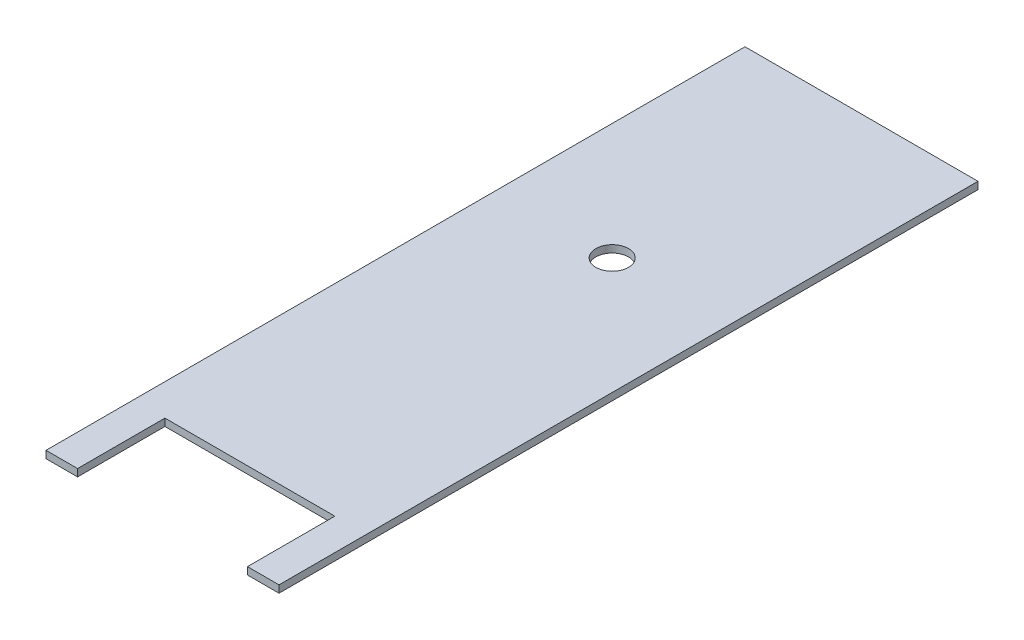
ISO-10303-21;
HEADER;
FILE_DESCRIPTION(('STEP AP214'),'2;1');
FILE_NAME('part.step','',(''),(''),'','','');
FILE_SCHEMA(('AUTOMOTIVE_DESIGN { 1 0 10303 214 1 1 1 1 }'));
ENDSEC;
DATA;
#1=APPLICATION_CONTEXT('core data for automotive mechanical design processes');
#2=APPLICATION_PROTOCOL_DEFINITION('international standard','automotive_design',2000,#1);
#3=PRODUCT_CONTEXT('',#1,'mechanical');
#4=PRODUCT('Part','Part','',(#3));
#5=PRODUCT_RELATED_PRODUCT_CATEGORY('part','',(#4));
#6=PRODUCT_DEFINITION_FORMATION('','',#4);
#7=PRODUCT_DEFINITION_CONTEXT('part definition',#1,'design');
#8=PRODUCT_DEFINITION('design','',#6,#7);
#9=PRODUCT_DEFINITION_SHAPE('','',#8);
#10=(LENGTH_UNIT() NAMED_UNIT(*) SI_UNIT(.MILLI.,.METRE.));
#11=(NAMED_UNIT(*) PLANE_ANGLE_UNIT() SI_UNIT($,.RADIAN.));
#12=(NAMED_UNIT(*) SI_UNIT($,.STERADIAN.) SOLID_ANGLE_UNIT());
#13=UNCERTAINTY_MEASURE_WITH_UNIT(LENGTH_MEASURE(1.E-05),#10,'distance_accuracy_value','');
#14=(GEOMETRIC_REPRESENTATION_CONTEXT(3) GLOBAL_UNCERTAINTY_ASSIGNED_CONTEXT((#13)) GLOBAL_UNIT_ASSIGNED_CONTEXT((#10,
#11,#12)) REPRESENTATION_CONTEXT('',''));
#15=CARTESIAN_POINT('',(0.,0.,0.));
#16=DIRECTION('',(0.,0.,1.));
#17=DIRECTION('',(1.,0.,0.));
#18=AXIS2_PLACEMENT_3D('',#15,#16,#17);
#19=CARTESIAN_POINT('',(-76.2,4.7625,228.6));
#20=DIRECTION('',(0.,0.,-1.));
#21=DIRECTION('',(-1.,0.,0.));
#22=AXIS2_PLACEMENT_3D('',#19,#20,#21);
#23=PLANE('',#22);
#24=DIRECTION('',(1.,0.,0.));
#25=VECTOR('',#24,1.);
#26=CARTESIAN_POINT('',(-76.2,0.,228.6));
#27=LINE('',#26,#25);
#28=CARTESIAN_POINT('',(-76.2,0.,228.6));
#29=VERTEX_POINT('',#28);
#30=CARTESIAN_POINT('',(-55.5625,0.,228.6));
#31=VERTEX_POINT('',#30);
#32=EDGE_CURVE('E161',#29,#31,#27,.T.);
#33=ORIENTED_EDGE('',*,*,#32,.T.);
#34=DIRECTION('',(0.,1.,0.));
#35=VECTOR('',#34,1.);
#36=CARTESIAN_POINT('',(-55.5625,0.,228.6));
#37=LINE('',#36,#35);
#38=CARTESIAN_POINT('',(-55.5625,4.7625,228.6));
#39=VERTEX_POINT('',#38);
#40=EDGE_CURVE('E152',#31,#39,#37,.T.);
#41=ORIENTED_EDGE('',*,*,#40,.T.);
#42=DIRECTION('',(1.,0.,0.));
#43=VECTOR('',#42,1.);
#44=CARTESIAN_POINT('',(-76.2,4.7625,228.6));
#45=LINE('',#44,#43);
#46=CARTESIAN_POINT('',(-76.2,4.7625,228.6));
#47=VERTEX_POINT('',#46);
#48=EDGE_CURVE('E138',#47,#39,#45,.T.);
#49=ORIENTED_EDGE('',*,*,#48,.F.);
#50=DIRECTION('',(0.,-1.,0.));
#51=VECTOR('',#50,1.);
#52=CARTESIAN_POINT('',(-76.2,4.7625,228.6));
#53=LINE('',#52,#51);
#54=EDGE_CURVE('E185',#47,#29,#53,.T.);
#55=ORIENTED_EDGE('',*,*,#54,.T.);
#56=EDGE_LOOP('',(#33,#41,#49,#55));
#57=FACE_BOUND('',#56,.T.);
#58=ADVANCED_FACE('F42',(#57),#23,.F.);
#59=CARTESIAN_POINT('',(76.2,4.7625,228.6));
#60=DIRECTION('',(-1.,0.,0.));
#61=DIRECTION('',(0.,0.,1.));
#62=AXIS2_PLACEMENT_3D('',#59,#60,#61);
#63=PLANE('',#62);
#64=DIRECTION('',(0.,0.,-1.));
#65=VECTOR('',#64,1.);
#66=CARTESIAN_POINT('',(76.2,0.,228.6));
#67=LINE('',#66,#65);
#68=CARTESIAN_POINT('',(76.2,0.,228.6));
#69=VERTEX_POINT('',#68);
#70=CARTESIAN_POINT('',(76.2,0.,-228.6));
#71=VERTEX_POINT('',#70);
#72=EDGE_CURVE('E170',#69,#71,#67,.T.);
#73=ORIENTED_EDGE('',*,*,#72,.T.);
#74=DIRECTION('',(0.,-1.,0.));
#75=VECTOR('',#74,1.);
#76=CARTESIAN_POINT('',(76.2,4.7625,-228.6));
#77=LINE('',#76,#75);
#78=CARTESIAN_POINT('',(76.2,4.7625,-228.6));
#79=VERTEX_POINT('',#78);
#80=EDGE_CURVE('E11',#79,#71,#77,.T.);
#81=ORIENTED_EDGE('',*,*,#80,.F.);
#82=DIRECTION('',(0.,0.,-1.));
#83=VECTOR('',#82,1.);
#84=CARTESIAN_POINT('',(76.2,4.7625,228.6));
#85=LINE('',#84,#83);
#86=CARTESIAN_POINT('',(76.2,4.7625,228.6));
#87=VERTEX_POINT('',#86);
#88=EDGE_CURVE('E158',#87,#79,#85,.T.);
#89=ORIENTED_EDGE('',*,*,#88,.F.);
#90=DIRECTION('',(0.,-1.,0.));
#91=VECTOR('',#90,1.);
#92=CARTESIAN_POINT('',(76.2,4.7625,228.6));
#93=LINE('',#92,#91);
#94=EDGE_CURVE('E169',#87,#69,#93,.T.);
#95=ORIENTED_EDGE('',*,*,#94,.T.);
#96=EDGE_LOOP('',(#73,#81,#89,#95));
#97=FACE_BOUND('',#96,.T.);
#98=ADVANCED_FACE('F44',(#97),#63,.F.);
#99=CARTESIAN_POINT('',(-76.2,4.7625,-228.6));
#100=DIRECTION('',(0.,0.,1.));
#101=DIRECTION('',(1.,0.,0.));
#102=AXIS2_PLACEMENT_3D('',#99,#100,#101);
#103=PLANE('',#102);
#104=DIRECTION('',(-1.,0.,0.));
#105=VECTOR('',#104,1.);
#106=CARTESIAN_POINT('',(-76.2,0.,-228.6));
#107=LINE('',#106,#105);
#108=CARTESIAN_POINT('',(-76.2,0.,-228.6));
#109=VERTEX_POINT('',#108);
#110=EDGE_CURVE('E174',#71,#109,#107,.T.);
#111=ORIENTED_EDGE('',*,*,#110,.T.);
#112=DIRECTION('',(0.,-1.,0.));
#113=VECTOR('',#112,1.);
#114=CARTESIAN_POINT('',(-76.2,4.7625,-228.6));
#115=LINE('',#114,#113);
#116=CARTESIAN_POINT('',(-76.2,4.7625,-228.6));
#117=VERTEX_POINT('',#116);
#118=EDGE_CURVE('E51',#117,#109,#115,.T.);
#119=ORIENTED_EDGE('',*,*,#118,.F.);
#120=DIRECTION('',(-1.,0.,0.));
#121=VECTOR('',#120,1.);
#122=CARTESIAN_POINT('',(-76.2,4.7625,-228.6));
#123=LINE('',#122,#121);
#124=EDGE_CURVE('E96',#79,#117,#123,.T.);
#125=ORIENTED_EDGE('',*,*,#124,.F.);
#126=ORIENTED_EDGE('',*,*,#80,.T.);
#127=EDGE_LOOP('',(#111,#119,#125,#126));
#128=FACE_BOUND('',#127,.T.);
#129=ADVANCED_FACE('F235',(#128),#103,.F.);
#130=CARTESIAN_POINT('',(-76.2,4.7625,228.6));
#131=DIRECTION('',(1.,0.,0.));
#132=DIRECTION('',(0.,0.,-1.));
#133=AXIS2_PLACEMENT_3D('',#130,#131,#132);
#134=PLANE('',#133);
#135=DIRECTION('',(0.,0.,1.));
#136=VECTOR('',#135,1.);
#137=CARTESIAN_POINT('',(-76.2,0.,228.6));
#138=LINE('',#137,#136);
#139=EDGE_CURVE('E177',#109,#29,#138,.T.);
#140=ORIENTED_EDGE('',*,*,#139,.T.);
#141=ORIENTED_EDGE('',*,*,#54,.F.);
#142=DIRECTION('',(0.,0.,1.));
#143=VECTOR('',#142,1.);
#144=CARTESIAN_POINT('',(-76.2,4.7625,228.6));
#145=LINE('',#144,#143);
#146=EDGE_CURVE('E164',#117,#47,#145,.T.);
#147=ORIENTED_EDGE('',*,*,#146,.F.);
#148=ORIENTED_EDGE('',*,*,#118,.T.);
#149=EDGE_LOOP('',(#140,#141,#147,#148));
#150=FACE_BOUND('',#149,.T.);
#151=ADVANCED_FACE('F193',(#150),#134,.F.);
#152=CARTESIAN_POINT('',(55.5625,4.7625,228.6));
#153=VERTEX_POINT('',#152);
#154=EDGE_CURVE('E67',#153,#87,#45,.T.);
#155=ORIENTED_EDGE('',*,*,#154,.F.);
#156=DIRECTION('',(0.,1.,0.));
#157=VECTOR('',#156,1.);
#158=CARTESIAN_POINT('',(55.5625,0.,228.6));
#159=LINE('',#158,#157);
#160=CARTESIAN_POINT('',(55.5625,0.,228.6));
#161=VERTEX_POINT('',#160);
#162=EDGE_CURVE('E201',#161,#153,#159,.T.);
#163=ORIENTED_EDGE('',*,*,#162,.F.);
#164=EDGE_CURVE('E89',#161,#69,#27,.T.);
#165=ORIENTED_EDGE('',*,*,#164,.T.);
#166=ORIENTED_EDGE('',*,*,#94,.F.);
#167=EDGE_LOOP('',(#155,#163,#165,#166));
#168=FACE_BOUND('',#167,.T.);
#169=ADVANCED_FACE('F221',(#168),#23,.F.);
#170=CARTESIAN_POINT('',(0.,4.7625,0.));
#171=DIRECTION('',(0.,-1.,0.));
#172=DIRECTION('',(0.,0.,-1.));
#173=AXIS2_PLACEMENT_3D('',#170,#171,#172);
#174=PLANE('',#173);
#175=CARTESIAN_POINT('',(0.,4.7625,-65.5319999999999));
#176=DIRECTION('',(0.,1.,0.));
#177=DIRECTION('',(0.,0.,1.));
#178=AXIS2_PLACEMENT_3D('',#175,#176,#177);
#179=CIRCLE('',#178,10.668);
#180=CARTESIAN_POINT('',(0.,4.7625,-54.8639999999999));
#181=VERTEX_POINT('',#180);
#182=EDGE_CURVE('E140',#181,#181,#179,.T.);
#183=ORIENTED_EDGE('',*,*,#182,.F.);
#184=EDGE_LOOP('',(#183));
#185=FACE_BOUND('',#184,.T.);
#186=ORIENTED_EDGE('',*,*,#48,.T.);
#187=DIRECTION('',(0.,0.,1.));
#188=VECTOR('',#187,1.);
#189=CARTESIAN_POINT('',(-55.5625,4.7625,228.6));
#190=LINE('',#189,#188);
#191=CARTESIAN_POINT('',(-55.5625,4.7625,171.45));
#192=VERTEX_POINT('',#191);
#193=EDGE_CURVE('E121',#192,#39,#190,.T.);
#194=ORIENTED_EDGE('',*,*,#193,.F.);
#195=DIRECTION('',(-1.,0.,0.));
#196=VECTOR('',#195,1.);
#197=CARTESIAN_POINT('',(-55.5625,4.7625,171.45));
#198=LINE('',#197,#196);
#199=CARTESIAN_POINT('',(55.5625,4.7625,171.45));
#200=VERTEX_POINT('',#199);
#201=EDGE_CURVE('E129',#200,#192,#198,.T.);
#202=ORIENTED_EDGE('',*,*,#201,.F.);
#203=DIRECTION('',(0.,0.,-1.));
#204=VECTOR('',#203,1.);
#205=CARTESIAN_POINT('',(55.5625,4.7625,228.6));
#206=LINE('',#205,#204);
#207=EDGE_CURVE('E133',#153,#200,#206,.T.);
#208=ORIENTED_EDGE('',*,*,#207,.F.);
#209=ORIENTED_EDGE('',*,*,#154,.T.);
#210=ORIENTED_EDGE('',*,*,#88,.T.);
#211=ORIENTED_EDGE('',*,*,#124,.T.);
#212=ORIENTED_EDGE('',*,*,#146,.T.);
#213=EDGE_LOOP('',(#186,#194,#202,#208,#209,#210,#211,#212));
#214=FACE_BOUND('',#213,.T.);
#215=ADVANCED_FACE('F136',(#185,#214),#174,.F.);
#216=CARTESIAN_POINT('',(0.,0.,0.));
#217=DIRECTION('',(0.,-1.,0.));
#218=DIRECTION('',(0.,0.,-1.));
#219=AXIS2_PLACEMENT_3D('',#216,#217,#218);
#220=PLANE('',#219);
#221=CARTESIAN_POINT('',(0.,0.,-65.5319999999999));
#222=DIRECTION('',(0.,1.,0.));
#223=DIRECTION('',(0.,0.,1.));
#224=AXIS2_PLACEMENT_3D('',#221,#222,#223);
#225=CIRCLE('',#224,10.668);
#226=CARTESIAN_POINT('',(0.,0.,-54.8639999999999));
#227=VERTEX_POINT('',#226);
#228=EDGE_CURVE('E145',#227,#227,#225,.T.);
#229=ORIENTED_EDGE('',*,*,#228,.T.);
#230=EDGE_LOOP('',(#229));
#231=FACE_BOUND('',#230,.T.);
#232=DIRECTION('',(0.,0.,1.));
#233=VECTOR('',#232,1.);
#234=CARTESIAN_POINT('',(-55.5625,0.,228.6));
#235=LINE('',#234,#233);
#236=CARTESIAN_POINT('',(-55.5625,0.,171.45));
#237=VERTEX_POINT('',#236);
#238=EDGE_CURVE('E124',#237,#31,#235,.T.);
#239=ORIENTED_EDGE('',*,*,#238,.T.);
#240=ORIENTED_EDGE('',*,*,#32,.F.);
#241=ORIENTED_EDGE('',*,*,#139,.F.);
#242=ORIENTED_EDGE('',*,*,#110,.F.);
#243=ORIENTED_EDGE('',*,*,#72,.F.);
#244=ORIENTED_EDGE('',*,*,#164,.F.);
#245=DIRECTION('',(0.,0.,-1.));
#246=VECTOR('',#245,1.);
#247=CARTESIAN_POINT('',(55.5625,0.,228.6));
#248=LINE('',#247,#246);
#249=CARTESIAN_POINT('',(55.5625,0.,171.45));
#250=VERTEX_POINT('',#249);
#251=EDGE_CURVE('E151',#161,#250,#248,.T.);
#252=ORIENTED_EDGE('',*,*,#251,.T.);
#253=DIRECTION('',(-1.,0.,0.));
#254=VECTOR('',#253,1.);
#255=CARTESIAN_POINT('',(-55.5625,0.,171.45));
#256=LINE('',#255,#254);
#257=EDGE_CURVE('E58',#250,#237,#256,.T.);
#258=ORIENTED_EDGE('',*,*,#257,.T.);
#259=EDGE_LOOP('',(#239,#240,#241,#242,#243,#244,#252,#258));
#260=FACE_BOUND('',#259,.T.);
#261=ADVANCED_FACE('F197',(#231,#260),#220,.T.);
#262=CARTESIAN_POINT('',(-55.5625,0.,228.6));
#263=DIRECTION('',(-1.,0.,0.));
#264=DIRECTION('',(0.,-1.,0.));
#265=AXIS2_PLACEMENT_3D('',#262,#263,#264);
#266=PLANE('',#265);
#267=ORIENTED_EDGE('',*,*,#193,.T.);
#268=ORIENTED_EDGE('',*,*,#40,.F.);
#269=ORIENTED_EDGE('',*,*,#238,.F.);
#270=DIRECTION('',(0.,1.,0.));
#271=VECTOR('',#270,1.);
#272=CARTESIAN_POINT('',(-55.5625,0.,171.45));
#273=LINE('',#272,#271);
#274=EDGE_CURVE('E117',#237,#192,#273,.T.);
#275=ORIENTED_EDGE('',*,*,#274,.T.);
#276=EDGE_LOOP('',(#267,#268,#269,#275));
#277=FACE_BOUND('',#276,.T.);
#278=ADVANCED_FACE('F119',(#277),#266,.F.);
#279=CARTESIAN_POINT('',(-55.5625,0.,171.45));
#280=DIRECTION('',(0.,0.,-1.));
#281=DIRECTION('',(0.,1.,0.));
#282=AXIS2_PLACEMENT_3D('',#279,#280,#281);
#283=PLANE('',#282);
#284=ORIENTED_EDGE('',*,*,#201,.T.);
#285=ORIENTED_EDGE('',*,*,#274,.F.);
#286=ORIENTED_EDGE('',*,*,#257,.F.);
#287=DIRECTION('',(0.,1.,0.));
#288=VECTOR('',#287,1.);
#289=CARTESIAN_POINT('',(55.5625,0.,171.45));
#290=LINE('',#289,#288);
#291=EDGE_CURVE('E126',#250,#200,#290,.T.);
#292=ORIENTED_EDGE('',*,*,#291,.T.);
#293=EDGE_LOOP('',(#284,#285,#286,#292));
#294=FACE_BOUND('',#293,.T.);
#295=ADVANCED_FACE('F130',(#294),#283,.F.);
#296=CARTESIAN_POINT('',(55.5625,0.,228.6));
#297=DIRECTION('',(1.,0.,0.));
#298=DIRECTION('',(0.,1.,0.));
#299=AXIS2_PLACEMENT_3D('',#296,#297,#298);
#300=PLANE('',#299);
#301=ORIENTED_EDGE('',*,*,#207,.T.);
#302=ORIENTED_EDGE('',*,*,#291,.F.);
#303=ORIENTED_EDGE('',*,*,#251,.F.);
#304=ORIENTED_EDGE('',*,*,#162,.T.);
#305=EDGE_LOOP('',(#301,#302,#303,#304));
#306=FACE_BOUND('',#305,.T.);
#307=ADVANCED_FACE('F216',(#306),#300,.F.);
#308=CARTESIAN_POINT('',(0.,0.,-65.5319999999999));
#309=DIRECTION('',(0.,1.,0.));
#310=DIRECTION('',(0.,0.,1.));
#311=AXIS2_PLACEMENT_3D('',#308,#309,#310);
#312=CYLINDRICAL_SURFACE('',#311,10.668);
#313=CARTESIAN_POINT('',(0.,0.,-54.8639999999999));
#314=CARTESIAN_POINT('',(0.,0.049609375,-54.8639999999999));
#315=CARTESIAN_POINT('',(0.,0.09921875,-54.8639999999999));
#316=CARTESIAN_POINT('',(0.,0.1984375,-54.8639999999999));
#317=CARTESIAN_POINT('',(0.,0.248046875,-54.8639999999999));
#318=CARTESIAN_POINT('',(0.,0.347265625,-54.8639999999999));
#319=CARTESIAN_POINT('',(0.,0.396875,-54.8639999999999));
#320=CARTESIAN_POINT('',(0.,0.49609375,-54.8639999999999));
#321=CARTESIAN_POINT('',(0.,0.545703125,-54.8639999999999));
#322=CARTESIAN_POINT('',(0.,0.644921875,-54.8639999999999));
#323=CARTESIAN_POINT('',(0.,0.69453125,-54.8639999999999));
#324=CARTESIAN_POINT('',(0.,0.79375,-54.8639999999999));
#325=CARTESIAN_POINT('',(0.,0.843359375,-54.8639999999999));
#326=CARTESIAN_POINT('',(0.,0.942578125,-54.8639999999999));
#327=CARTESIAN_POINT('',(0.,0.9921875,-54.8639999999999));
#328=CARTESIAN_POINT('',(0.,1.09140625,-54.8639999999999));
#329=CARTESIAN_POINT('',(0.,1.141015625,-54.8639999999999));
#330=CARTESIAN_POINT('',(0.,1.240234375,-54.8639999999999));
#331=CARTESIAN_POINT('',(0.,1.28984375,-54.8639999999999));
#332=CARTESIAN_POINT('',(0.,1.3890625,-54.8639999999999));
#333=CARTESIAN_POINT('',(0.,1.438671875,-54.8639999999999));
#334=CARTESIAN_POINT('',(0.,1.537890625,-54.8639999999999));
#335=CARTESIAN_POINT('',(0.,1.5875,-54.8639999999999));
#336=CARTESIAN_POINT('',(0.,1.68671875,-54.8639999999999));
#337=CARTESIAN_POINT('',(0.,1.736328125,-54.8639999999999));
#338=CARTESIAN_POINT('',(0.,1.835546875,-54.8639999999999));
#339=CARTESIAN_POINT('',(0.,1.88515625,-54.8639999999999));
#340=CARTESIAN_POINT('',(0.,1.984375,-54.8639999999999));
#341=CARTESIAN_POINT('',(0.,2.033984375,-54.8639999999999));
#342=CARTESIAN_POINT('',(0.,2.133203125,-54.8639999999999));
#343=CARTESIAN_POINT('',(0.,2.1828125,-54.8639999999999));
#344=CARTESIAN_POINT('',(0.,2.28203125,-54.8639999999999));
#345=CARTESIAN_POINT('',(0.,2.331640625,-54.8639999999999));
#346=CARTESIAN_POINT('',(0.,2.430859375,-54.8639999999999));
#347=CARTESIAN_POINT('',(0.,2.48046875,-54.8639999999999));
#348=CARTESIAN_POINT('',(0.,2.5796875,-54.8639999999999));
#349=CARTESIAN_POINT('',(0.,2.629296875,-54.8639999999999));
#350=CARTESIAN_POINT('',(0.,2.728515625,-54.8639999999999));
#351=CARTESIAN_POINT('',(0.,2.778125,-54.8639999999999));
#352=CARTESIAN_POINT('',(0.,2.87734375,-54.8639999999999));
#353=CARTESIAN_POINT('',(0.,2.926953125,-54.8639999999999));
#354=CARTESIAN_POINT('',(0.,3.026171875,-54.8639999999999));
#355=CARTESIAN_POINT('',(0.,3.07578125,-54.8639999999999));
#356=CARTESIAN_POINT('',(0.,3.175,-54.8639999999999));
#357=CARTESIAN_POINT('',(0.,3.224609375,-54.8639999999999));
#358=CARTESIAN_POINT('',(0.,3.323828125,-54.8639999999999));
#359=CARTESIAN_POINT('',(0.,3.3734375,-54.8639999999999));
#360=CARTESIAN_POINT('',(0.,3.47265625,-54.8639999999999));
#361=CARTESIAN_POINT('',(0.,3.522265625,-54.8639999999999));
#362=CARTESIAN_POINT('',(0.,3.621484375,-54.8639999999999));
#363=CARTESIAN_POINT('',(0.,3.67109375,-54.8639999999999));
#364=CARTESIAN_POINT('',(0.,3.7703125,-54.8639999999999));
#365=CARTESIAN_POINT('',(0.,3.819921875,-54.8639999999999));
#366=CARTESIAN_POINT('',(0.,3.919140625,-54.8639999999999));
#367=CARTESIAN_POINT('',(0.,3.96875,-54.8639999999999));
#368=CARTESIAN_POINT('',(0.,4.06796875,-54.8639999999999));
#369=CARTESIAN_POINT('',(0.,4.117578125,-54.8639999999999));
#370=CARTESIAN_POINT('',(0.,4.216796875,-54.8639999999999));
#371=CARTESIAN_POINT('',(0.,4.26640625,-54.8639999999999));
#372=CARTESIAN_POINT('',(0.,4.365625,-54.8639999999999));
#373=CARTESIAN_POINT('',(0.,4.415234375,-54.8639999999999));
#374=CARTESIAN_POINT('',(0.,4.514453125,-54.8639999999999));
#375=CARTESIAN_POINT('',(0.,4.5640625,-54.8639999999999));
#376=CARTESIAN_POINT('',(0.,4.66328125,-54.8639999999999));
#377=CARTESIAN_POINT('',(0.,4.712890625,-54.8639999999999));
#378=CARTESIAN_POINT('',(0.,4.7625,-54.8639999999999));
#379=B_SPLINE_CURVE_WITH_KNOTS('',3,(#313,#314,#315,#316,#317,#318,#319,#320,#321,#322,#323,
#324,#325,#326,#327,#328,#329,#330,#331,#332,#333,#334,#335,#336,#337,#338,#339,#340,#341,#342,
#343,#344,#345,#346,#347,#348,#349,#350,#351,#352,#353,#354,#355,#356,#357,#358,#359,#360,#361,
#362,#363,#364,#365,#366,#367,#368,#369,#370,#371,#372,#373,#374,#375,#376,#377,#378),
.UNSPECIFIED.,.F.,.F.,(4,2,2,2,2,2,2,2,2,2,2,2,2,2,2,2,2,2,2,2,2,2,2,2,2,2,2,2,2,2,2,2,4),(0.,
0.148828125,0.29765625,0.446484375,0.5953125,0.744140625,0.89296875,1.041796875,1.190625,
1.339453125,1.48828125,1.637109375,1.7859375,1.934765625,2.08359375,2.232421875,2.38125,
2.530078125,2.67890625,2.827734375,2.9765625,3.125390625,3.27421875,3.423046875,3.571875,
3.720703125,3.86953125,4.018359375,4.1671875,4.316015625,4.46484375,4.613671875,4.7625),.UNSPECIFIED.);
#380=EDGE_CURVE('BSEAM213',#227,#181,#379,.T.);
#381=ORIENTED_EDGE('',*,*,#228,.F.);
#382=ORIENTED_EDGE('',*,*,#182,.T.);
#383=ORIENTED_EDGE('',*,*,#380,.T.);
#384=ORIENTED_EDGE('',*,*,#380,.F.);
#385=EDGE_LOOP('',(#381,#383,#382,#384));
#386=FACE_BOUND('',#385,.T.);
#387=ADVANCED_FACE('F213',(#386),#312,.F.);
#388=CLOSED_SHELL('',(#58,#98,#129,#151,#169,#215,#261,#278,#295,#307,#387));
#389=MANIFOLD_SOLID_BREP('B2',#388);
#390=ADVANCED_BREP_SHAPE_REPRESENTATION('',(#18,#389),#14);
#391=SHAPE_DEFINITION_REPRESENTATION(#9,#390);
ENDSEC;
END-ISO-10303-21;
